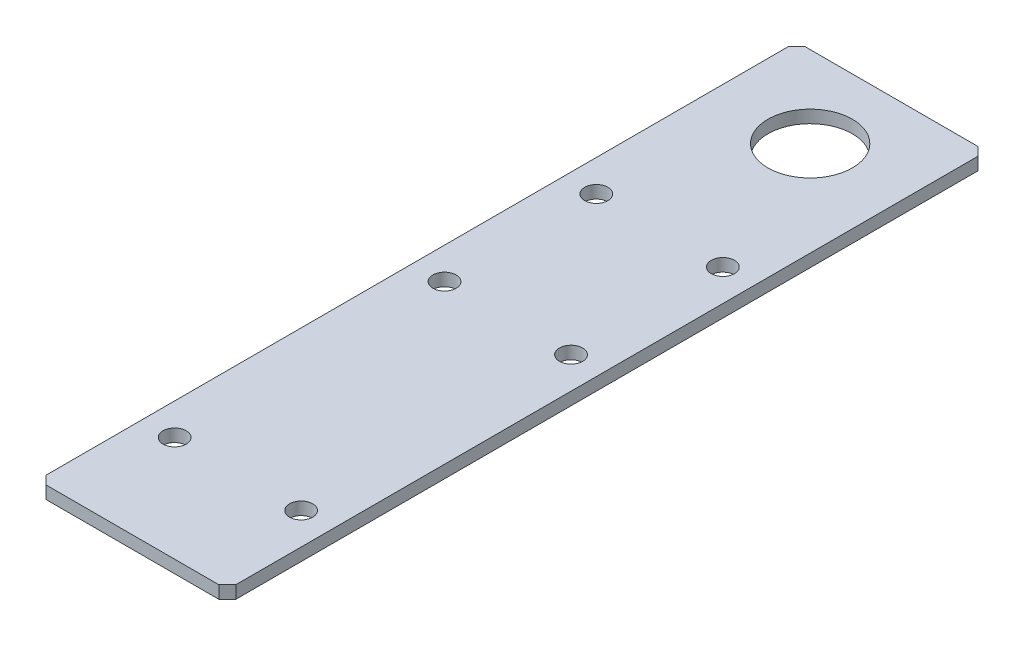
ISO-10303-21;
HEADER;
FILE_DESCRIPTION(('STEP AP214'),'2;1');
FILE_NAME('part.step','',(''),(''),'','','');
FILE_SCHEMA(('AUTOMOTIVE_DESIGN { 1 0 10303 214 1 1 1 1 }'));
ENDSEC;
DATA;
#1=APPLICATION_CONTEXT('core data for automotive mechanical design processes');
#2=APPLICATION_PROTOCOL_DEFINITION('international standard','automotive_design',2000,#1);
#3=PRODUCT_CONTEXT('',#1,'mechanical');
#4=PRODUCT('Part','Part','',(#3));
#5=PRODUCT_RELATED_PRODUCT_CATEGORY('part','',(#4));
#6=PRODUCT_DEFINITION_FORMATION('','',#4);
#7=PRODUCT_DEFINITION_CONTEXT('part definition',#1,'design');
#8=PRODUCT_DEFINITION('design','',#6,#7);
#9=PRODUCT_DEFINITION_SHAPE('','',#8);
#10=(LENGTH_UNIT() NAMED_UNIT(*) SI_UNIT(.MILLI.,.METRE.));
#11=(NAMED_UNIT(*) PLANE_ANGLE_UNIT() SI_UNIT($,.RADIAN.));
#12=(NAMED_UNIT(*) SI_UNIT($,.STERADIAN.) SOLID_ANGLE_UNIT());
#13=UNCERTAINTY_MEASURE_WITH_UNIT(LENGTH_MEASURE(1.E-05),#10,'distance_accuracy_value','');
#14=(GEOMETRIC_REPRESENTATION_CONTEXT(3) GLOBAL_UNCERTAINTY_ASSIGNED_CONTEXT((#13)) GLOBAL_UNIT_ASSIGNED_CONTEXT((#10,
#11,#12)) REPRESENTATION_CONTEXT('',''));
#15=CARTESIAN_POINT('',(0.,0.,0.));
#16=DIRECTION('',(0.,0.,1.));
#17=DIRECTION('',(1.,0.,0.));
#18=AXIS2_PLACEMENT_3D('',#15,#16,#17);
#19=CARTESIAN_POINT('',(22.5,3.,-90.));
#20=DIRECTION('',(-1.,0.,0.));
#21=DIRECTION('',(0.,0.,-1.));
#22=AXIS2_PLACEMENT_3D('',#19,#20,#21);
#23=PLANE('',#22);
#24=DIRECTION('',(0.,1.,0.));
#25=VECTOR('',#24,1.);
#26=CARTESIAN_POINT('',(22.5,3.,88.));
#27=LINE('',#26,#25);
#28=CARTESIAN_POINT('',(22.5,0.,88.));
#29=VERTEX_POINT('',#28);
#30=CARTESIAN_POINT('',(22.5,3.,88.));
#31=VERTEX_POINT('',#30);
#32=EDGE_CURVE('E11',#29,#31,#27,.T.);
#33=ORIENTED_EDGE('',*,*,#32,.F.);
#34=DIRECTION('',(0.,0.,-1.));
#35=VECTOR('',#34,1.);
#36=CARTESIAN_POINT('',(22.5,0.,90.));
#37=LINE('',#36,#35);
#38=CARTESIAN_POINT('',(22.5,0.,-88.));
#39=VERTEX_POINT('',#38);
#40=EDGE_CURVE('E101',#29,#39,#37,.T.);
#41=ORIENTED_EDGE('',*,*,#40,.T.);
#42=DIRECTION('',(0.,1.,0.));
#43=VECTOR('',#42,1.);
#44=CARTESIAN_POINT('',(22.5,3.,-88.));
#45=LINE('',#44,#43);
#46=CARTESIAN_POINT('',(22.5,3.,-88.));
#47=VERTEX_POINT('',#46);
#48=EDGE_CURVE('E44',#39,#47,#45,.T.);
#49=ORIENTED_EDGE('',*,*,#48,.T.);
#50=DIRECTION('',(0.,0.,-1.));
#51=VECTOR('',#50,1.);
#52=CARTESIAN_POINT('',(22.5,3.,-90.));
#53=LINE('',#52,#51);
#54=EDGE_CURVE('E143',#31,#47,#53,.T.);
#55=ORIENTED_EDGE('',*,*,#54,.F.);
#56=EDGE_LOOP('',(#33,#41,#49,#55));
#57=FACE_BOUND('',#56,.T.);
#58=ADVANCED_FACE('F34',(#57),#23,.F.);
#59=CARTESIAN_POINT('',(20.5,3.,-90.));
#60=DIRECTION('',(0.707106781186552,0.,-0.707106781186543));
#61=DIRECTION('',(0.707106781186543,0.,0.707106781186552));
#62=AXIS2_PLACEMENT_3D('',#59,#60,#61);
#63=PLANE('',#62);
#64=ORIENTED_EDGE('',*,*,#48,.F.);
#65=DIRECTION('',(0.707106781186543,0.,0.707106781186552));
#66=VECTOR('',#65,1.);
#67=CARTESIAN_POINT('',(20.5,0.,-90.));
#68=LINE('',#67,#66);
#69=CARTESIAN_POINT('',(20.5,0.,-90.));
#70=VERTEX_POINT('',#69);
#71=EDGE_CURVE('E123',#39,#70,#68,.F.);
#72=ORIENTED_EDGE('',*,*,#71,.T.);
#73=DIRECTION('',(0.,1.,0.));
#74=VECTOR('',#73,1.);
#75=CARTESIAN_POINT('',(20.5,3.,-90.));
#76=LINE('',#75,#74);
#77=CARTESIAN_POINT('',(20.5,3.,-90.));
#78=VERTEX_POINT('',#77);
#79=EDGE_CURVE('E136',#70,#78,#76,.T.);
#80=ORIENTED_EDGE('',*,*,#79,.T.);
#81=DIRECTION('',(0.707106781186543,0.,0.707106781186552));
#82=VECTOR('',#81,1.);
#83=CARTESIAN_POINT('',(20.5,3.,-90.));
#84=LINE('',#83,#82);
#85=EDGE_CURVE('E152',#47,#78,#84,.F.);
#86=ORIENTED_EDGE('',*,*,#85,.F.);
#87=EDGE_LOOP('',(#64,#72,#80,#86));
#88=FACE_BOUND('',#87,.T.);
#89=ADVANCED_FACE('F155',(#88),#63,.T.);
#90=CARTESIAN_POINT('',(22.5,3.,-90.));
#91=DIRECTION('',(0.,0.,1.));
#92=DIRECTION('',(-1.,0.,0.));
#93=AXIS2_PLACEMENT_3D('',#90,#91,#92);
#94=PLANE('',#93);
#95=ORIENTED_EDGE('',*,*,#79,.F.);
#96=DIRECTION('',(1.,0.,0.));
#97=VECTOR('',#96,1.);
#98=CARTESIAN_POINT('',(-22.5,0.,-90.));
#99=LINE('',#98,#97);
#100=CARTESIAN_POINT('',(-20.5,0.,-90.));
#101=VERTEX_POINT('',#100);
#102=EDGE_CURVE('E120',#70,#101,#99,.F.);
#103=ORIENTED_EDGE('',*,*,#102,.T.);
#104=DIRECTION('',(0.,1.,0.));
#105=VECTOR('',#104,1.);
#106=CARTESIAN_POINT('',(-20.5,3.,-90.));
#107=LINE('',#106,#105);
#108=CARTESIAN_POINT('',(-20.5,3.,-90.));
#109=VERTEX_POINT('',#108);
#110=EDGE_CURVE('E133',#101,#109,#107,.T.);
#111=ORIENTED_EDGE('',*,*,#110,.T.);
#112=DIRECTION('',(-1.,0.,0.));
#113=VECTOR('',#112,1.);
#114=CARTESIAN_POINT('',(22.5,3.,-90.));
#115=LINE('',#114,#113);
#116=EDGE_CURVE('E156',#78,#109,#115,.T.);
#117=ORIENTED_EDGE('',*,*,#116,.F.);
#118=EDGE_LOOP('',(#95,#103,#111,#117));
#119=FACE_BOUND('',#118,.T.);
#120=ADVANCED_FACE('F208',(#119),#94,.F.);
#121=CARTESIAN_POINT('',(-22.5,3.,-88.));
#122=DIRECTION('',(-0.707106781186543,0.,-0.707106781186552));
#123=DIRECTION('',(0.707106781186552,0.,-0.707106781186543));
#124=AXIS2_PLACEMENT_3D('',#121,#122,#123);
#125=PLANE('',#124);
#126=ORIENTED_EDGE('',*,*,#110,.F.);
#127=DIRECTION('',(0.707106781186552,0.,-0.707106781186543));
#128=VECTOR('',#127,1.);
#129=CARTESIAN_POINT('',(-22.5,0.,-88.));
#130=LINE('',#129,#128);
#131=CARTESIAN_POINT('',(-22.5,0.,-88.));
#132=VERTEX_POINT('',#131);
#133=EDGE_CURVE('E117',#101,#132,#130,.F.);
#134=ORIENTED_EDGE('',*,*,#133,.T.);
#135=DIRECTION('',(0.,1.,0.));
#136=VECTOR('',#135,1.);
#137=CARTESIAN_POINT('',(-22.5,3.,-88.));
#138=LINE('',#137,#136);
#139=CARTESIAN_POINT('',(-22.5,3.,-88.));
#140=VERTEX_POINT('',#139);
#141=EDGE_CURVE('E130',#132,#140,#138,.T.);
#142=ORIENTED_EDGE('',*,*,#141,.T.);
#143=DIRECTION('',(0.707106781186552,0.,-0.707106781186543));
#144=VECTOR('',#143,1.);
#145=CARTESIAN_POINT('',(-22.5,3.,-88.));
#146=LINE('',#145,#144);
#147=EDGE_CURVE('E158',#109,#140,#146,.F.);
#148=ORIENTED_EDGE('',*,*,#147,.F.);
#149=EDGE_LOOP('',(#126,#134,#142,#148));
#150=FACE_BOUND('',#149,.T.);
#151=ADVANCED_FACE('F213',(#150),#125,.T.);
#152=CARTESIAN_POINT('',(-22.5,3.,-90.));
#153=DIRECTION('',(1.,0.,0.));
#154=DIRECTION('',(0.,0.,1.));
#155=AXIS2_PLACEMENT_3D('',#152,#153,#154);
#156=PLANE('',#155);
#157=ORIENTED_EDGE('',*,*,#141,.F.);
#158=DIRECTION('',(0.,0.,-1.));
#159=VECTOR('',#158,1.);
#160=CARTESIAN_POINT('',(-22.5,0.,90.));
#161=LINE('',#160,#159);
#162=CARTESIAN_POINT('',(-22.5,0.,88.));
#163=VERTEX_POINT('',#162);
#164=EDGE_CURVE('E114',#132,#163,#161,.F.);
#165=ORIENTED_EDGE('',*,*,#164,.T.);
#166=DIRECTION('',(0.,1.,0.));
#167=VECTOR('',#166,1.);
#168=CARTESIAN_POINT('',(-22.5,3.,88.));
#169=LINE('',#168,#167);
#170=CARTESIAN_POINT('',(-22.5,3.,88.));
#171=VERTEX_POINT('',#170);
#172=EDGE_CURVE('E128',#163,#171,#169,.T.);
#173=ORIENTED_EDGE('',*,*,#172,.T.);
#174=DIRECTION('',(0.,0.,1.));
#175=VECTOR('',#174,1.);
#176=CARTESIAN_POINT('',(-22.5,3.,-90.));
#177=LINE('',#176,#175);
#178=EDGE_CURVE('E164',#140,#171,#177,.T.);
#179=ORIENTED_EDGE('',*,*,#178,.F.);
#180=EDGE_LOOP('',(#157,#165,#173,#179));
#181=FACE_BOUND('',#180,.T.);
#182=ADVANCED_FACE('F217',(#181),#156,.F.);
#183=CARTESIAN_POINT('',(-20.5,3.,90.));
#184=DIRECTION('',(-0.707106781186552,0.,0.707106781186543));
#185=DIRECTION('',(-0.707106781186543,0.,-0.707106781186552));
#186=AXIS2_PLACEMENT_3D('',#183,#184,#185);
#187=PLANE('',#186);
#188=ORIENTED_EDGE('',*,*,#172,.F.);
#189=DIRECTION('',(-0.707106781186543,0.,-0.707106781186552));
#190=VECTOR('',#189,1.);
#191=CARTESIAN_POINT('',(-20.5,0.,90.));
#192=LINE('',#191,#190);
#193=CARTESIAN_POINT('',(-20.5,0.,90.));
#194=VERTEX_POINT('',#193);
#195=EDGE_CURVE('E111',#163,#194,#192,.F.);
#196=ORIENTED_EDGE('',*,*,#195,.T.);
#197=DIRECTION('',(0.,1.,0.));
#198=VECTOR('',#197,1.);
#199=CARTESIAN_POINT('',(-20.5,3.,90.));
#200=LINE('',#199,#198);
#201=CARTESIAN_POINT('',(-20.5,3.,90.));
#202=VERTEX_POINT('',#201);
#203=EDGE_CURVE('E52',#194,#202,#200,.T.);
#204=ORIENTED_EDGE('',*,*,#203,.T.);
#205=DIRECTION('',(-0.707106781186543,0.,-0.707106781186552));
#206=VECTOR('',#205,1.);
#207=CARTESIAN_POINT('',(-20.5,3.,90.));
#208=LINE('',#207,#206);
#209=EDGE_CURVE('E94',#171,#202,#208,.F.);
#210=ORIENTED_EDGE('',*,*,#209,.F.);
#211=EDGE_LOOP('',(#188,#196,#204,#210));
#212=FACE_BOUND('',#211,.T.);
#213=ADVANCED_FACE('F221',(#212),#187,.T.);
#214=CARTESIAN_POINT('',(22.5,3.,90.));
#215=DIRECTION('',(0.,0.,-1.));
#216=DIRECTION('',(1.,0.,0.));
#217=AXIS2_PLACEMENT_3D('',#214,#215,#216);
#218=PLANE('',#217);
#219=ORIENTED_EDGE('',*,*,#203,.F.);
#220=DIRECTION('',(1.,0.,0.));
#221=VECTOR('',#220,1.);
#222=CARTESIAN_POINT('',(-22.5,0.,90.));
#223=LINE('',#222,#221);
#224=CARTESIAN_POINT('',(20.5,0.,90.));
#225=VERTEX_POINT('',#224);
#226=EDGE_CURVE('E99',#194,#225,#223,.T.);
#227=ORIENTED_EDGE('',*,*,#226,.T.);
#228=DIRECTION('',(0.,1.,0.));
#229=VECTOR('',#228,1.);
#230=CARTESIAN_POINT('',(20.5,3.,90.));
#231=LINE('',#230,#229);
#232=CARTESIAN_POINT('',(20.5,3.,90.));
#233=VERTEX_POINT('',#232);
#234=EDGE_CURVE('E38',#225,#233,#231,.T.);
#235=ORIENTED_EDGE('',*,*,#234,.T.);
#236=DIRECTION('',(1.,0.,0.));
#237=VECTOR('',#236,1.);
#238=CARTESIAN_POINT('',(22.5,3.,90.));
#239=LINE('',#238,#237);
#240=EDGE_CURVE('E281',#202,#233,#239,.T.);
#241=ORIENTED_EDGE('',*,*,#240,.F.);
#242=EDGE_LOOP('',(#219,#227,#235,#241));
#243=FACE_BOUND('',#242,.T.);
#244=ADVANCED_FACE('F103',(#243),#218,.F.);
#245=CARTESIAN_POINT('',(0.,3.,-70.7));
#246=DIRECTION('',(0.,1.,0.));
#247=DIRECTION('',(0.,0.,1.));
#248=AXIS2_PLACEMENT_3D('',#245,#246,#247);
#249=CYLINDRICAL_SURFACE('',#248,10.01);
#250=CARTESIAN_POINT('',(0.,3.,-70.7));
#251=DIRECTION('',(0.,1.,0.));
#252=DIRECTION('',(0.,0.,1.));
#253=AXIS2_PLACEMENT_3D('',#250,#251,#252);
#254=CIRCLE('',#253,10.01);
#255=CARTESIAN_POINT('',(0.,3.,-60.69));
#256=VERTEX_POINT('',#255);
#257=EDGE_CURVE('E113',#256,#256,#254,.T.);
#258=ORIENTED_EDGE('',*,*,#257,.T.);
#259=EDGE_LOOP('',(#258));
#260=FACE_BOUND('',#259,.T.);
#261=CARTESIAN_POINT('',(0.,0.,-70.7));
#262=DIRECTION('',(0.,1.,0.));
#263=DIRECTION('',(0.,0.,1.));
#264=AXIS2_PLACEMENT_3D('',#261,#262,#263);
#265=CIRCLE('',#264,10.01);
#266=CARTESIAN_POINT('',(0.,0.,-60.69));
#267=VERTEX_POINT('',#266);
#268=EDGE_CURVE('E169',#267,#267,#265,.T.);
#269=ORIENTED_EDGE('',*,*,#268,.F.);
#270=EDGE_LOOP('',(#269));
#271=FACE_BOUND('',#270,.T.);
#272=ADVANCED_FACE('F226',(#260,#271),#249,.F.);
#273=CARTESIAN_POINT('',(-15.,3.,65.));
#274=DIRECTION('',(0.,1.,0.));
#275=DIRECTION('',(0.,0.,1.));
#276=AXIS2_PLACEMENT_3D('',#273,#274,#275);
#277=CYLINDRICAL_SURFACE('',#276,2.75);
#278=CARTESIAN_POINT('',(-15.,3.,65.));
#279=DIRECTION('',(0.,1.,0.));
#280=DIRECTION('',(0.,0.,-1.));
#281=AXIS2_PLACEMENT_3D('',#278,#279,#280);
#282=CIRCLE('',#281,2.75);
#283=CARTESIAN_POINT('',(-15.,3.,62.25));
#284=VERTEX_POINT('',#283);
#285=EDGE_CURVE('E273',#284,#284,#282,.T.);
#286=ORIENTED_EDGE('',*,*,#285,.T.);
#287=EDGE_LOOP('',(#286));
#288=FACE_BOUND('',#287,.T.);
#289=CARTESIAN_POINT('',(-15.,0.,65.));
#290=DIRECTION('',(0.,1.,0.));
#291=DIRECTION('',(0.,0.,1.));
#292=AXIS2_PLACEMENT_3D('',#289,#290,#291);
#293=CIRCLE('',#292,2.75);
#294=CARTESIAN_POINT('',(-15.,0.,67.75));
#295=VERTEX_POINT('',#294);
#296=EDGE_CURVE('E172',#295,#295,#293,.T.);
#297=ORIENTED_EDGE('',*,*,#296,.F.);
#298=EDGE_LOOP('',(#297));
#299=FACE_BOUND('',#298,.T.);
#300=ADVANCED_FACE('F230',(#288,#299),#277,.F.);
#301=CARTESIAN_POINT('',(-15.,3.,1.));
#302=DIRECTION('',(0.,1.,0.));
#303=DIRECTION('',(0.,0.,1.));
#304=AXIS2_PLACEMENT_3D('',#301,#302,#303);
#305=CYLINDRICAL_SURFACE('',#304,2.75);
#306=CARTESIAN_POINT('',(-15.,3.,1.));
#307=DIRECTION('',(0.,1.,0.));
#308=DIRECTION('',(0.,0.,-1.));
#309=AXIS2_PLACEMENT_3D('',#306,#307,#308);
#310=CIRCLE('',#309,2.75);
#311=CARTESIAN_POINT('',(-15.,3.,-1.75));
#312=VERTEX_POINT('',#311);
#313=EDGE_CURVE('E267',#312,#312,#310,.T.);
#314=ORIENTED_EDGE('',*,*,#313,.T.);
#315=EDGE_LOOP('',(#314));
#316=FACE_BOUND('',#315,.T.);
#317=CARTESIAN_POINT('',(-15.,0.,1.));
#318=DIRECTION('',(0.,1.,0.));
#319=DIRECTION('',(0.,0.,1.));
#320=AXIS2_PLACEMENT_3D('',#317,#318,#319);
#321=CIRCLE('',#320,2.75);
#322=CARTESIAN_POINT('',(-15.,0.,3.75));
#323=VERTEX_POINT('',#322);
#324=EDGE_CURVE('E175',#323,#323,#321,.T.);
#325=ORIENTED_EDGE('',*,*,#324,.F.);
#326=EDGE_LOOP('',(#325));
#327=FACE_BOUND('',#326,.T.);
#328=ADVANCED_FACE('F247',(#316,#327),#305,.F.);
#329=CARTESIAN_POINT('',(-15.,3.,-35.));
#330=DIRECTION('',(0.,1.,0.));
#331=DIRECTION('',(0.,0.,1.));
#332=AXIS2_PLACEMENT_3D('',#329,#330,#331);
#333=CYLINDRICAL_SURFACE('',#332,2.75);
#334=CARTESIAN_POINT('',(-15.,3.,-35.));
#335=DIRECTION('',(0.,1.,0.));
#336=DIRECTION('',(0.,0.,-1.));
#337=AXIS2_PLACEMENT_3D('',#334,#335,#336);
#338=CIRCLE('',#337,2.75);
#339=CARTESIAN_POINT('',(-15.,3.,-37.75));
#340=VERTEX_POINT('',#339);
#341=EDGE_CURVE('E259',#340,#340,#338,.T.);
#342=ORIENTED_EDGE('',*,*,#341,.T.);
#343=EDGE_LOOP('',(#342));
#344=FACE_BOUND('',#343,.T.);
#345=CARTESIAN_POINT('',(-15.,0.,-35.));
#346=DIRECTION('',(0.,1.,0.));
#347=DIRECTION('',(0.,0.,1.));
#348=AXIS2_PLACEMENT_3D('',#345,#346,#347);
#349=CIRCLE('',#348,2.75);
#350=CARTESIAN_POINT('',(-15.,0.,-32.25));
#351=VERTEX_POINT('',#350);
#352=EDGE_CURVE('E178',#351,#351,#349,.T.);
#353=ORIENTED_EDGE('',*,*,#352,.F.);
#354=EDGE_LOOP('',(#353));
#355=FACE_BOUND('',#354,.T.);
#356=ADVANCED_FACE('F200',(#344,#355),#333,.F.);
#357=CARTESIAN_POINT('',(15.,3.,65.));
#358=DIRECTION('',(0.,1.,0.));
#359=DIRECTION('',(0.,0.,1.));
#360=AXIS2_PLACEMENT_3D('',#357,#358,#359);
#361=CYLINDRICAL_SURFACE('',#360,2.75);
#362=CARTESIAN_POINT('',(15.,3.,65.));
#363=DIRECTION('',(0.,1.,0.));
#364=DIRECTION('',(0.,0.,1.));
#365=AXIS2_PLACEMENT_3D('',#362,#363,#364);
#366=CIRCLE('',#365,2.75);
#367=CARTESIAN_POINT('',(15.,3.,67.75));
#368=VERTEX_POINT('',#367);
#369=EDGE_CURVE('E266',#368,#368,#366,.T.);
#370=ORIENTED_EDGE('',*,*,#369,.T.);
#371=EDGE_LOOP('',(#370));
#372=FACE_BOUND('',#371,.T.);
#373=CARTESIAN_POINT('',(15.,0.,65.));
#374=DIRECTION('',(0.,1.,0.));
#375=DIRECTION('',(0.,0.,1.));
#376=AXIS2_PLACEMENT_3D('',#373,#374,#375);
#377=CIRCLE('',#376,2.75);
#378=CARTESIAN_POINT('',(15.,0.,67.75));
#379=VERTEX_POINT('',#378);
#380=EDGE_CURVE('E181',#379,#379,#377,.T.);
#381=ORIENTED_EDGE('',*,*,#380,.F.);
#382=EDGE_LOOP('',(#381));
#383=FACE_BOUND('',#382,.T.);
#384=ADVANCED_FACE('F191',(#372,#383),#361,.F.);
#385=CARTESIAN_POINT('',(15.,3.,1.));
#386=DIRECTION('',(0.,1.,0.));
#387=DIRECTION('',(0.,0.,1.));
#388=AXIS2_PLACEMENT_3D('',#385,#386,#387);
#389=CYLINDRICAL_SURFACE('',#388,2.75);
#390=CARTESIAN_POINT('',(15.,3.,1.));
#391=DIRECTION('',(0.,1.,0.));
#392=DIRECTION('',(0.,0.,1.));
#393=AXIS2_PLACEMENT_3D('',#390,#391,#392);
#394=CIRCLE('',#393,2.75);
#395=CARTESIAN_POINT('',(15.,3.,3.75));
#396=VERTEX_POINT('',#395);
#397=EDGE_CURVE('E270',#396,#396,#394,.T.);
#398=ORIENTED_EDGE('',*,*,#397,.T.);
#399=EDGE_LOOP('',(#398));
#400=FACE_BOUND('',#399,.T.);
#401=CARTESIAN_POINT('',(15.,0.,1.));
#402=DIRECTION('',(0.,1.,0.));
#403=DIRECTION('',(0.,0.,1.));
#404=AXIS2_PLACEMENT_3D('',#401,#402,#403);
#405=CIRCLE('',#404,2.75);
#406=CARTESIAN_POINT('',(15.,0.,3.75));
#407=VERTEX_POINT('',#406);
#408=EDGE_CURVE('E107',#407,#407,#405,.T.);
#409=ORIENTED_EDGE('',*,*,#408,.F.);
#410=EDGE_LOOP('',(#409));
#411=FACE_BOUND('',#410,.T.);
#412=ADVANCED_FACE('F188',(#400,#411),#389,.F.);
#413=CARTESIAN_POINT('',(15.,3.,-35.));
#414=DIRECTION('',(0.,1.,0.));
#415=DIRECTION('',(0.,0.,1.));
#416=AXIS2_PLACEMENT_3D('',#413,#414,#415);
#417=CYLINDRICAL_SURFACE('',#416,2.75);
#418=CARTESIAN_POINT('',(15.,3.,-35.));
#419=DIRECTION('',(0.,1.,0.));
#420=DIRECTION('',(0.,0.,1.));
#421=AXIS2_PLACEMENT_3D('',#418,#419,#420);
#422=CIRCLE('',#421,2.75);
#423=CARTESIAN_POINT('',(15.,3.,-32.25));
#424=VERTEX_POINT('',#423);
#425=EDGE_CURVE('E278',#424,#424,#422,.T.);
#426=ORIENTED_EDGE('',*,*,#425,.T.);
#427=EDGE_LOOP('',(#426));
#428=FACE_BOUND('',#427,.T.);
#429=CARTESIAN_POINT('',(15.,0.,-35.));
#430=DIRECTION('',(0.,1.,0.));
#431=DIRECTION('',(0.,0.,1.));
#432=AXIS2_PLACEMENT_3D('',#429,#430,#431);
#433=CIRCLE('',#432,2.75);
#434=CARTESIAN_POINT('',(15.,0.,-32.25));
#435=VERTEX_POINT('',#434);
#436=EDGE_CURVE('E104',#435,#435,#433,.T.);
#437=ORIENTED_EDGE('',*,*,#436,.F.);
#438=EDGE_LOOP('',(#437));
#439=FACE_BOUND('',#438,.T.);
#440=ADVANCED_FACE('F190',(#428,#439),#417,.F.);
#441=CARTESIAN_POINT('',(22.5,3.,88.));
#442=DIRECTION('',(0.707106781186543,0.,0.707106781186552));
#443=DIRECTION('',(-0.707106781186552,0.,0.707106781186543));
#444=AXIS2_PLACEMENT_3D('',#441,#442,#443);
#445=PLANE('',#444);
#446=DIRECTION('',(-0.707106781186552,0.,0.707106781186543));
#447=VECTOR('',#446,1.);
#448=CARTESIAN_POINT('',(22.5,0.,88.));
#449=LINE('',#448,#447);
#450=EDGE_CURVE('E88',#225,#29,#449,.F.);
#451=ORIENTED_EDGE('',*,*,#450,.T.);
#452=ORIENTED_EDGE('',*,*,#32,.T.);
#453=DIRECTION('',(-0.707106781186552,0.,0.707106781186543));
#454=VECTOR('',#453,1.);
#455=CARTESIAN_POINT('',(22.5,3.,88.));
#456=LINE('',#455,#454);
#457=EDGE_CURVE('E90',#233,#31,#456,.F.);
#458=ORIENTED_EDGE('',*,*,#457,.F.);
#459=ORIENTED_EDGE('',*,*,#234,.F.);
#460=EDGE_LOOP('',(#451,#452,#458,#459));
#461=FACE_BOUND('',#460,.T.);
#462=ADVANCED_FACE('F36',(#461),#445,.T.);
#463=CARTESIAN_POINT('',(-22.5,3.,90.));
#464=DIRECTION('',(0.,-1.,0.));
#465=DIRECTION('',(0.,0.,-1.));
#466=AXIS2_PLACEMENT_3D('',#463,#464,#465);
#467=PLANE('',#466);
#468=ORIENTED_EDGE('',*,*,#257,.F.);
#469=EDGE_LOOP('',(#468));
#470=FACE_BOUND('',#469,.T.);
#471=ORIENTED_EDGE('',*,*,#285,.F.);
#472=EDGE_LOOP('',(#471));
#473=FACE_BOUND('',#472,.T.);
#474=ORIENTED_EDGE('',*,*,#313,.F.);
#475=EDGE_LOOP('',(#474));
#476=FACE_BOUND('',#475,.T.);
#477=ORIENTED_EDGE('',*,*,#341,.F.);
#478=EDGE_LOOP('',(#477));
#479=FACE_BOUND('',#478,.T.);
#480=ORIENTED_EDGE('',*,*,#369,.F.);
#481=EDGE_LOOP('',(#480));
#482=FACE_BOUND('',#481,.T.);
#483=ORIENTED_EDGE('',*,*,#397,.F.);
#484=EDGE_LOOP('',(#483));
#485=FACE_BOUND('',#484,.T.);
#486=ORIENTED_EDGE('',*,*,#425,.F.);
#487=EDGE_LOOP('',(#486));
#488=FACE_BOUND('',#487,.T.);
#489=ORIENTED_EDGE('',*,*,#240,.T.);
#490=ORIENTED_EDGE('',*,*,#457,.T.);
#491=ORIENTED_EDGE('',*,*,#54,.T.);
#492=ORIENTED_EDGE('',*,*,#85,.T.);
#493=ORIENTED_EDGE('',*,*,#116,.T.);
#494=ORIENTED_EDGE('',*,*,#147,.T.);
#495=ORIENTED_EDGE('',*,*,#178,.T.);
#496=ORIENTED_EDGE('',*,*,#209,.T.);
#497=EDGE_LOOP('',(#489,#490,#491,#492,#493,#494,#495,#496));
#498=FACE_BOUND('',#497,.T.);
#499=ADVANCED_FACE('F150',(#470,#473,#476,#479,#482,#485,#488,#498),#467,.F.);
#500=CARTESIAN_POINT('',(-22.5,0.,90.));
#501=DIRECTION('',(0.,-1.,0.));
#502=DIRECTION('',(0.,0.,-1.));
#503=AXIS2_PLACEMENT_3D('',#500,#501,#502);
#504=PLANE('',#503);
#505=ORIENTED_EDGE('',*,*,#268,.T.);
#506=EDGE_LOOP('',(#505));
#507=FACE_BOUND('',#506,.T.);
#508=ORIENTED_EDGE('',*,*,#296,.T.);
#509=EDGE_LOOP('',(#508));
#510=FACE_BOUND('',#509,.T.);
#511=ORIENTED_EDGE('',*,*,#324,.T.);
#512=EDGE_LOOP('',(#511));
#513=FACE_BOUND('',#512,.T.);
#514=ORIENTED_EDGE('',*,*,#352,.T.);
#515=EDGE_LOOP('',(#514));
#516=FACE_BOUND('',#515,.T.);
#517=ORIENTED_EDGE('',*,*,#380,.T.);
#518=EDGE_LOOP('',(#517));
#519=FACE_BOUND('',#518,.T.);
#520=ORIENTED_EDGE('',*,*,#408,.T.);
#521=EDGE_LOOP('',(#520));
#522=FACE_BOUND('',#521,.T.);
#523=ORIENTED_EDGE('',*,*,#436,.T.);
#524=EDGE_LOOP('',(#523));
#525=FACE_BOUND('',#524,.T.);
#526=ORIENTED_EDGE('',*,*,#226,.F.);
#527=ORIENTED_EDGE('',*,*,#195,.F.);
#528=ORIENTED_EDGE('',*,*,#164,.F.);
#529=ORIENTED_EDGE('',*,*,#133,.F.);
#530=ORIENTED_EDGE('',*,*,#102,.F.);
#531=ORIENTED_EDGE('',*,*,#71,.F.);
#532=ORIENTED_EDGE('',*,*,#40,.F.);
#533=ORIENTED_EDGE('',*,*,#450,.F.);
#534=EDGE_LOOP('',(#526,#527,#528,#529,#530,#531,#532,#533));
#535=FACE_BOUND('',#534,.T.);
#536=ADVANCED_FACE('F97',(#507,#510,#513,#516,#519,#522,#525,#535),#504,.T.);
#537=CLOSED_SHELL('',(#58,#89,#120,#151,#182,#213,#244,#272,#300,#328,#356,#384,#412,#440,#462,
#499,#536));
#538=MANIFOLD_SOLID_BREP('B2',#537);
#539=ADVANCED_BREP_SHAPE_REPRESENTATION('',(#18,#538),#14);
#540=SHAPE_DEFINITION_REPRESENTATION(#9,#539);
ENDSEC;
END-ISO-10303-21;
